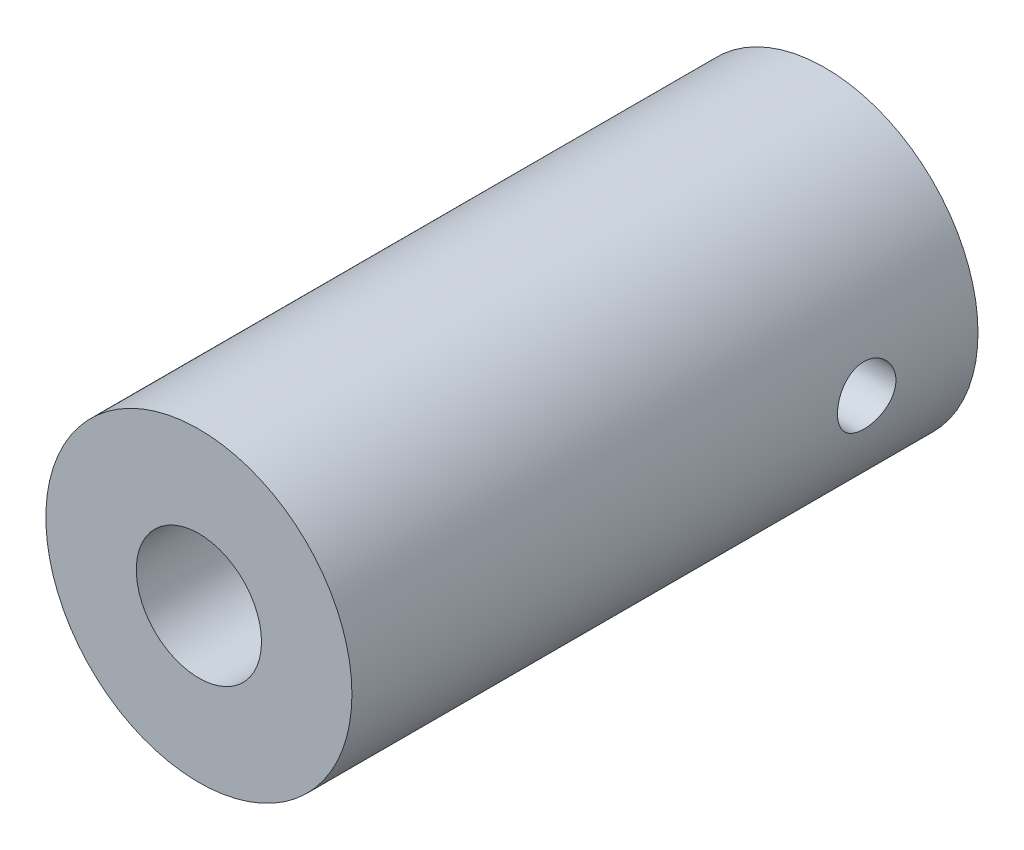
ISO-10303-21;
HEADER;
FILE_DESCRIPTION(('STEP AP214'),'2;1');
FILE_NAME('part.step','',(''),(''),'','','');
FILE_SCHEMA(('AUTOMOTIVE_DESIGN { 1 0 10303 214 1 1 1 1 }'));
ENDSEC;
DATA;
#1=APPLICATION_CONTEXT('core data for automotive mechanical design processes');
#2=APPLICATION_PROTOCOL_DEFINITION('international standard','automotive_design',2000,#1);
#3=PRODUCT_CONTEXT('',#1,'mechanical');
#4=PRODUCT('Part','Part','',(#3));
#5=PRODUCT_RELATED_PRODUCT_CATEGORY('part','',(#4));
#6=PRODUCT_DEFINITION_FORMATION('','',#4);
#7=PRODUCT_DEFINITION_CONTEXT('part definition',#1,'design');
#8=PRODUCT_DEFINITION('design','',#6,#7);
#9=PRODUCT_DEFINITION_SHAPE('','',#8);
#10=(LENGTH_UNIT() NAMED_UNIT(*) SI_UNIT(.MILLI.,.METRE.));
#11=(NAMED_UNIT(*) PLANE_ANGLE_UNIT() SI_UNIT($,.RADIAN.));
#12=(NAMED_UNIT(*) SI_UNIT($,.STERADIAN.) SOLID_ANGLE_UNIT());
#13=UNCERTAINTY_MEASURE_WITH_UNIT(LENGTH_MEASURE(1.E-05),#10,'distance_accuracy_value','');
#14=(GEOMETRIC_REPRESENTATION_CONTEXT(3) GLOBAL_UNCERTAINTY_ASSIGNED_CONTEXT((#13)) GLOBAL_UNIT_ASSIGNED_CONTEXT((#10,
#11,#12)) REPRESENTATION_CONTEXT('',''));
#15=CARTESIAN_POINT('',(0.,0.,0.));
#16=DIRECTION('',(0.,0.,1.));
#17=DIRECTION('',(1.,0.,0.));
#18=AXIS2_PLACEMENT_3D('',#15,#16,#17);
#19=CARTESIAN_POINT('',(0.,0.,45.));
#20=DIRECTION('',(0.,0.,1.));
#21=DIRECTION('',(1.,0.,0.));
#22=AXIS2_PLACEMENT_3D('',#19,#20,#21);
#23=PLANE('',#22);
#24=CARTESIAN_POINT('',(0.,0.,45.));
#25=DIRECTION('',(0.,0.,1.));
#26=DIRECTION('',(1.,0.,0.));
#27=AXIS2_PLACEMENT_3D('',#24,#25,#26);
#28=CIRCLE('',#27,11.);
#29=CARTESIAN_POINT('',(11.,0.,45.));
#30=VERTEX_POINT('',#29);
#31=EDGE_CURVE('E10',#30,#30,#28,.T.);
#32=ORIENTED_EDGE('',*,*,#31,.T.);
#33=EDGE_LOOP('',(#32));
#34=FACE_BOUND('',#33,.T.);
#35=CARTESIAN_POINT('',(0.,0.,45.));
#36=DIRECTION('',(0.,0.,1.));
#37=DIRECTION('',(1.,0.,0.));
#38=AXIS2_PLACEMENT_3D('',#35,#36,#37);
#39=CIRCLE('',#38,4.5);
#40=CARTESIAN_POINT('',(4.5,0.,45.));
#41=VERTEX_POINT('',#40);
#42=EDGE_CURVE('E46',#41,#41,#39,.T.);
#43=ORIENTED_EDGE('',*,*,#42,.F.);
#44=EDGE_LOOP('',(#43));
#45=FACE_BOUND('',#44,.T.);
#46=ADVANCED_FACE('F34',(#34,#45),#23,.T.);
#47=CARTESIAN_POINT('',(0.,0.,0.));
#48=DIRECTION('',(0.,0.,1.));
#49=DIRECTION('',(1.,0.,0.));
#50=AXIS2_PLACEMENT_3D('',#47,#48,#49);
#51=PLANE('',#50);
#52=CARTESIAN_POINT('',(0.,0.,0.));
#53=DIRECTION('',(0.,0.,1.));
#54=DIRECTION('',(1.,0.,0.));
#55=AXIS2_PLACEMENT_3D('',#52,#53,#54);
#56=CIRCLE('',#55,11.);
#57=CARTESIAN_POINT('',(11.,0.,0.));
#58=VERTEX_POINT('',#57);
#59=EDGE_CURVE('E39',#58,#58,#56,.T.);
#60=ORIENTED_EDGE('',*,*,#59,.F.);
#61=EDGE_LOOP('',(#60));
#62=FACE_BOUND('',#61,.T.);
#63=CARTESIAN_POINT('',(0.,0.,0.));
#64=DIRECTION('',(0.,0.,1.));
#65=DIRECTION('',(1.,0.,0.));
#66=AXIS2_PLACEMENT_3D('',#63,#64,#65);
#67=CIRCLE('',#66,4.5);
#68=CARTESIAN_POINT('',(4.5,0.,0.));
#69=VERTEX_POINT('',#68);
#70=EDGE_CURVE('E48',#69,#69,#67,.T.);
#71=ORIENTED_EDGE('',*,*,#70,.T.);
#72=EDGE_LOOP('',(#71));
#73=FACE_BOUND('',#72,.T.);
#74=ADVANCED_FACE('F77',(#62,#73),#51,.F.);
#75=CARTESIAN_POINT('',(0.,0.,45.));
#76=DIRECTION('',(0.,0.,-1.));
#77=DIRECTION('',(-1.,0.,0.));
#78=AXIS2_PLACEMENT_3D('',#75,#76,#77);
#79=CYLINDRICAL_SURFACE('',#78,11.);
#80=CARTESIAN_POINT('',(11.,0.,5.90000000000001));
#81=CARTESIAN_POINT('',(10.9999978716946,-0.116820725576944,5.90000442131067));
#82=CARTESIAN_POINT('',(10.998119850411,-0.233698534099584,5.90978085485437));
#83=CARTESIAN_POINT('',(10.9908091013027,-0.464157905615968,5.94860153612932));
#84=CARTESIAN_POINT('',(10.9853734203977,-0.57773664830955,5.977661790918));
#85=CARTESIAN_POINT('',(10.971555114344,-0.798231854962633,6.05412567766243));
#86=CARTESIAN_POINT('',(10.9631751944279,-0.905154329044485,6.10151247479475));
#87=CARTESIAN_POINT('',(10.9443823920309,-1.10952197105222,6.2132359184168));
#88=CARTESIAN_POINT('',(10.9339696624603,-1.20696785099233,6.27757129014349));
#89=CARTESIAN_POINT('',(10.9121153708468,-1.39083315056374,6.42221180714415));
#90=CARTESIAN_POINT('',(10.9006636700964,-1.47711814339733,6.50268631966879));
#91=CARTESIAN_POINT('',(10.8780969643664,-1.63504914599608,6.67695647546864));
#92=CARTESIAN_POINT('',(10.8669819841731,-1.70669408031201,6.77075309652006));
#93=CARTESIAN_POINT('',(10.846248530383,-1.83387383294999,6.96995946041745));
#94=CARTESIAN_POINT('',(10.8366431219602,-1.88927125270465,7.07545840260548));
#95=CARTESIAN_POINT('',(10.8201595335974,-1.98150370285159,7.2944798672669));
#96=CARTESIAN_POINT('',(10.8132811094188,-2.01834039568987,7.4080016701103));
#97=CARTESIAN_POINT('',(10.8031324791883,-2.07197297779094,7.63840588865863));
#98=CARTESIAN_POINT('',(10.7998200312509,-2.08900368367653,7.75523174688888));
#99=CARTESIAN_POINT('',(10.7970511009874,-2.10326984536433,7.99012603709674));
#100=CARTESIAN_POINT('',(10.7975942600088,-2.10050714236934,8.10819435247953));
#101=CARTESIAN_POINT('',(10.8024367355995,-2.07545516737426,8.34051636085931));
#102=CARTESIAN_POINT('',(10.8066845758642,-2.05343348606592,8.45480014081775));
#103=CARTESIAN_POINT('',(10.8183768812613,-1.99091034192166,8.67802067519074));
#104=CARTESIAN_POINT('',(10.8258214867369,-1.95040806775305,8.78695719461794));
#105=CARTESIAN_POINT('',(10.8431219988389,-1.85181340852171,8.99717070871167));
#106=CARTESIAN_POINT('',(10.8529925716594,-1.79361350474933,9.09839601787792));
#107=CARTESIAN_POINT('',(10.8740232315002,-1.66135166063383,9.28974462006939));
#108=CARTESIAN_POINT('',(10.8851834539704,-1.5872880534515,9.37986674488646));
#109=CARTESIAN_POINT('',(10.9077598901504,-1.42396113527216,9.54799627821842));
#110=CARTESIAN_POINT('',(10.9191773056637,-1.33446907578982,9.62578148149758));
#111=CARTESIAN_POINT('',(10.9408141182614,-1.14358963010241,9.76526924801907));
#112=CARTESIAN_POINT('',(10.9510335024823,-1.04220211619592,9.82697163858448));
#113=CARTESIAN_POINT('',(10.9691445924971,-0.830173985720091,9.9325772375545));
#114=CARTESIAN_POINT('',(10.9770331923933,-0.719521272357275,9.9764567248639));
#115=CARTESIAN_POINT('',(10.9895700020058,-0.492231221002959,10.0449430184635));
#116=CARTESIAN_POINT('',(10.994218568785,-0.375594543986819,10.0695519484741));
#117=CARTESIAN_POINT('',(10.9997023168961,-0.141558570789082,10.098487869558));
#118=CARTESIAN_POINT('',(11.0005947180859,-0.0241982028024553,10.1031192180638));
#119=CARTESIAN_POINT('',(10.9986238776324,0.209619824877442,10.092785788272));
#120=CARTESIAN_POINT('',(10.9957608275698,0.326077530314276,10.0778220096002));
#121=CARTESIAN_POINT('',(10.9866364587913,0.553814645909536,10.0289760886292));
#122=CARTESIAN_POINT('',(10.9804029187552,0.665128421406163,9.99524852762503));
#123=CARTESIAN_POINT('',(10.9652337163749,0.880521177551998,9.91000016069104));
#124=CARTESIAN_POINT('',(10.9562978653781,0.984599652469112,9.85847811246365));
#125=CARTESIAN_POINT('',(10.9365725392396,1.18386224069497,9.73843371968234));
#126=CARTESIAN_POINT('',(10.9257632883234,1.27893275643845,9.66972613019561));
#127=CARTESIAN_POINT('',(10.9035399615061,1.45630391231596,9.51751097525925));
#128=CARTESIAN_POINT('',(10.8921258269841,1.53860331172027,9.4340019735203));
#129=CARTESIAN_POINT('',(10.8697885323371,1.68925742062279,9.2531745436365));
#130=CARTESIAN_POINT('',(10.8588743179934,1.75740408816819,9.15568149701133));
#131=CARTESIAN_POINT('',(10.8389551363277,1.87635388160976,8.95045311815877));
#132=CARTESIAN_POINT('',(10.8299500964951,1.92715766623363,8.84271817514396));
#133=CARTESIAN_POINT('',(10.8149396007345,2.00968750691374,8.6205830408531));
#134=CARTESIAN_POINT('',(10.8089194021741,2.0415074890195,8.50621878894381));
#135=CARTESIAN_POINT('',(10.8005271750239,2.08545491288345,8.27364102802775));
#136=CARTESIAN_POINT('',(10.7981547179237,2.09758466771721,8.15542797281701));
#137=CARTESIAN_POINT('',(10.7973488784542,2.10172771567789,7.92059341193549));
#138=CARTESIAN_POINT('',(10.7988512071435,2.09406932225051,7.8039777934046));
#139=CARTESIAN_POINT('',(10.8054828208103,2.05957380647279,7.57372906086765));
#140=CARTESIAN_POINT('',(10.8106120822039,2.03273680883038,7.4600959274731));
#141=CARTESIAN_POINT('',(10.8238920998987,1.96078655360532,7.23922302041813));
#142=CARTESIAN_POINT('',(10.8320367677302,1.91571010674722,7.13197086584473));
#143=CARTESIAN_POINT('',(10.8504339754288,1.80859687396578,6.92649945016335));
#144=CARTESIAN_POINT('',(10.8606866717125,1.74655882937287,6.82828086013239));
#145=CARTESIAN_POINT('',(10.882343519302,1.60614737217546,6.64202264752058));
#146=CARTESIAN_POINT('',(10.8937630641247,1.52753550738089,6.55416454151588));
#147=CARTESIAN_POINT('',(10.9163530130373,1.35670385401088,6.39277743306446));
#148=CARTESIAN_POINT('',(10.9275233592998,1.26448094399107,6.31925172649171));
#149=CARTESIAN_POINT('',(10.9484794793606,1.06800710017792,6.18796989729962));
#150=CARTESIAN_POINT('',(10.9582512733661,0.963651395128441,6.13036826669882));
#151=CARTESIAN_POINT('',(10.9751724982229,0.746588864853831,6.03360797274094));
#152=CARTESIAN_POINT('',(10.9823243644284,0.633889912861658,5.99443217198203));
#153=CARTESIAN_POINT('',(10.9917600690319,0.434066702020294,5.94349243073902));
#154=CARTESIAN_POINT('',(10.9948324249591,0.348102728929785,5.92721096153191));
#155=CARTESIAN_POINT('',(10.9989531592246,0.174769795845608,5.90546323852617));
#156=CARTESIAN_POINT('',(11.0000015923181,0.0874008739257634,5.89999669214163));
#157=CARTESIAN_POINT('',(11.,0.,5.90000000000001));
#158=B_SPLINE_CURVE_WITH_KNOTS('',3,(#80,#81,#82,#83,#84,#85,#86,#87,#88,#89,#90,#91,#92,#93,
#94,#95,#96,#97,#98,#99,#100,#101,#102,#103,#104,#105,#106,#107,#108,#109,#110,#111,#112,#113,
#114,#115,#116,#117,#118,#119,#120,#121,#122,#123,#124,#125,#126,#127,#128,#129,#130,#131,#132,
#133,#134,#135,#136,#137,#138,#139,#140,#141,#142,#143,#144,#145,#146,#147,#148,#149,#150,#151,
#152,#153,#154,#155,#156,#157),.UNSPECIFIED.,.T.,.F.,(4,2,2,2,2,2,2,2,2,2,2,2,2,2,2,2,2,2,2,2,2,
2,2,2,2,2,2,2,2,2,2,2,2,2,2,2,2,2,4),(0.,0.350142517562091,0.700576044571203,1.05068842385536,
1.40077447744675,1.75474719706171,2.10874590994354,2.46565720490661,2.82253652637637,
3.17514016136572,3.52771099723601,3.87545955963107,4.22322339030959,4.5731437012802,
4.92310079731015,5.27878057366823,5.63446416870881,5.99061961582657,6.34673580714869,
6.69740698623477,7.0480602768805,7.39586667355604,7.74369735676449,8.09545238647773,
8.44724156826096,8.80388396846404,9.16051282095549,9.51536222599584,9.87016994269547,
10.2191288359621,10.5680854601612,10.9163413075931,11.2646230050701,11.6183069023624,
11.9720720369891,12.3291576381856,12.6859104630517,12.9478810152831,13.2098444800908),.UNSPECIFIED.);
#159=CARTESIAN_POINT('',(11.,0.,5.90000000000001));
#160=VERTEX_POINT('',#159);
#161=EDGE_CURVE('E51',#160,#160,#158,.T.);
#162=ORIENTED_EDGE('',*,*,#161,.T.);
#163=EDGE_LOOP('',(#162));
#164=FACE_BOUND('',#163,.T.);
#165=ORIENTED_EDGE('',*,*,#31,.F.);
#166=EDGE_LOOP('',(#165));
#167=FACE_BOUND('',#166,.T.);
#168=ORIENTED_EDGE('',*,*,#59,.T.);
#169=EDGE_LOOP('',(#168));
#170=FACE_BOUND('',#169,.T.);
#171=ADVANCED_FACE('F36',(#164,#167,#170),#79,.T.);
#172=CARTESIAN_POINT('',(0.,0.,45.));
#173=DIRECTION('',(0.,0.,-1.));
#174=DIRECTION('',(-1.,0.,0.));
#175=AXIS2_PLACEMENT_3D('',#172,#173,#174);
#176=CYLINDRICAL_SURFACE('',#175,4.5);
#177=CARTESIAN_POINT('',(4.5,0.,5.90000000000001));
#178=CARTESIAN_POINT('',(4.49999489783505,-0.111264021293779,5.9000060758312));
#179=CARTESIAN_POINT('',(4.49582799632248,-0.222686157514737,5.90889473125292));
#180=CARTESIAN_POINT('',(4.4795719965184,-0.442291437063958,5.94408163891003));
#181=CARTESIAN_POINT('',(4.46746534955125,-0.55046684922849,5.97041845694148));
#182=CARTESIAN_POINT('',(4.43660817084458,-0.760057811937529,6.03927763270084));
#183=CARTESIAN_POINT('',(4.41788225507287,-0.861496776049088,6.08174006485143));
#184=CARTESIAN_POINT('',(4.37554769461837,-1.05568597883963,6.18136145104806));
#185=CARTESIAN_POINT('',(4.35193986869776,-1.14843767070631,6.23851794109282));
#186=CARTESIAN_POINT('',(4.3005526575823,-1.32833402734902,6.36948602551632));
#187=CARTESIAN_POINT('',(4.27261570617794,-1.41489428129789,6.44403775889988));
#188=CARTESIAN_POINT('',(4.21629940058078,-1.57480810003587,6.60610128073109));
#189=CARTESIAN_POINT('',(4.18791976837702,-1.64815296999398,6.69362153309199));
#190=CARTESIAN_POINT('',(4.13182329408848,-1.78432392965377,6.88601550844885));
#191=CARTESIAN_POINT('',(4.10427039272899,-1.84615201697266,6.99164873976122));
#192=CARTESIAN_POINT('',(4.05553006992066,-1.95090689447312,7.21326250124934));
#193=CARTESIAN_POINT('',(4.03433858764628,-1.99384575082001,7.32923636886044));
#194=CARTESIAN_POINT('',(4.00246921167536,-2.05704583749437,7.5615630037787));
#195=CARTESIAN_POINT('',(3.99127033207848,-2.07843946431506,7.67753302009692));
#196=CARTESIAN_POINT('',(3.9792097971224,-2.1014464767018,7.91191423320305));
#197=CARTESIAN_POINT('',(3.97834008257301,-2.1030752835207,8.03032345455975));
#198=CARTESIAN_POINT('',(3.98660720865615,-2.08734488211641,8.25342826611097));
#199=CARTESIAN_POINT('',(3.99474416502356,-2.07188323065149,8.35830301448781));
#200=CARTESIAN_POINT('',(4.0183815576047,-2.02565458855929,8.56375111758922));
#201=CARTESIAN_POINT('',(4.03388388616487,-1.99488366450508,8.66432335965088));
#202=CARTESIAN_POINT('',(4.07086385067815,-1.9183074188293,8.86110828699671));
#203=CARTESIAN_POINT('',(4.09247103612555,-1.87217176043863,8.95716695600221));
#204=CARTESIAN_POINT('',(4.13921554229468,-1.76641808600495,9.14060899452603));
#205=CARTESIAN_POINT('',(4.16435440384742,-1.70679417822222,9.22798854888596));
#206=CARTESIAN_POINT('',(4.21863777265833,-1.56818654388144,9.401580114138));
#207=CARTESIAN_POINT('',(4.24792084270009,-1.48780370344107,9.48663528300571));
#208=CARTESIAN_POINT('',(4.30494408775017,-1.31371400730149,9.64250174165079));
#209=CARTESIAN_POINT('',(4.3326836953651,-1.22000229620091,9.71330781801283));
#210=CARTESIAN_POINT('',(4.38471347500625,-1.01763010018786,9.84098788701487));
#211=CARTESIAN_POINT('',(4.40884559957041,-0.90855606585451,9.89727584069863));
#212=CARTESIAN_POINT('',(4.4496578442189,-0.681071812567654,9.99027907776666));
#213=CARTESIAN_POINT('',(4.46634314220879,-0.562668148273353,10.0270079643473));
#214=CARTESIAN_POINT('',(4.48933753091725,-0.329445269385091,10.0771630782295));
#215=CARTESIAN_POINT('',(4.49633267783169,-0.215026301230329,10.09213423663));
#216=CARTESIAN_POINT('',(4.50144196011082,0.0148973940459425,10.1030950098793));
#217=CARTESIAN_POINT('',(4.49955954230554,0.130401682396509,10.0990919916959));
#218=CARTESIAN_POINT('',(4.48754815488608,0.35120799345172,10.0732103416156));
#219=CARTESIAN_POINT('',(4.47796715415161,0.456682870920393,10.052519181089));
#220=CARTESIAN_POINT('',(4.45217548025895,0.662492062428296,9.9956220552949));
#221=CARTESIAN_POINT('',(4.43596403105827,0.762825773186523,9.95941427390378));
#222=CARTESIAN_POINT('',(4.39779273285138,0.959019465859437,9.87141590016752));
#223=CARTESIAN_POINT('',(4.37567194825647,1.05464812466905,9.81918177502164));
#224=CARTESIAN_POINT('',(4.32791192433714,1.23612200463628,9.70109835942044));
#225=CARTESIAN_POINT('',(4.30227114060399,1.32196290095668,9.63524308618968));
#226=CARTESIAN_POINT('',(4.24736892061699,1.48939080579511,9.48507413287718));
#227=CARTESIAN_POINT('',(4.21798726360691,1.56994232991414,9.39964737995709));
#228=CARTESIAN_POINT('',(4.1607256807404,1.71596232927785,9.21623307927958));
#229=CARTESIAN_POINT('',(4.13284647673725,1.78142360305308,9.11823956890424));
#230=CARTESIAN_POINT('',(4.08097919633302,1.89730888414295,8.90831939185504));
#231=CARTESIAN_POINT('',(4.05714661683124,1.94717643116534,8.79604395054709));
#232=CARTESIAN_POINT('',(4.01797403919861,2.02679215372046,8.56321090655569));
#233=CARTESIAN_POINT('',(4.0026246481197,2.05656258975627,8.44266263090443));
#234=CARTESIAN_POINT('',(3.98384794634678,2.09268542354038,8.20838667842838));
#235=CARTESIAN_POINT('',(3.97947067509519,2.10090687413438,8.0950237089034));
#236=CARTESIAN_POINT('',(3.98051230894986,2.09893489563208,7.86851926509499));
#237=CARTESIAN_POINT('',(3.98592846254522,2.08874663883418,7.75537773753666));
#238=CARTESIAN_POINT('',(4.00499231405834,2.05192858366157,7.54114990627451));
#239=CARTESIAN_POINT('',(4.01801114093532,2.02655153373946,7.43978606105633));
#240=CARTESIAN_POINT('',(4.05017159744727,1.96148398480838,7.24280257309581));
#241=CARTESIAN_POINT('',(4.06931505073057,1.92178922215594,7.14718465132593));
#242=CARTESIAN_POINT('',(4.11312903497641,1.82622609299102,6.95744518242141));
#243=CARTESIAN_POINT('',(4.13808167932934,1.76946057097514,6.86384228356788));
#244=CARTESIAN_POINT('',(4.19011071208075,1.6424613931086,6.68691527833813));
#245=CARTESIAN_POINT('',(4.21718808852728,1.5722214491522,6.60359600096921));
#246=CARTESIAN_POINT('',(4.27367263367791,1.41196152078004,6.4409395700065));
#247=CARTESIAN_POINT('',(4.30304091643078,1.32066391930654,6.36284111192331));
#248=CARTESIAN_POINT('',(4.35820998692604,1.12529862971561,6.22288485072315));
#249=CARTESIAN_POINT('',(4.38400907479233,1.02122490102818,6.16103477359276));
#250=CARTESIAN_POINT('',(4.42908822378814,0.803416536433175,6.05601875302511));
#251=CARTESIAN_POINT('',(4.44840236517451,0.689736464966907,6.01275478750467));
#252=CARTESIAN_POINT('',(4.47840544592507,0.45573411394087,5.94646588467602));
#253=CARTESIAN_POINT('',(4.48912004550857,0.335432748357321,5.92338071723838));
#254=CARTESIAN_POINT('',(4.4966016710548,0.178484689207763,5.90729147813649));
#255=CARTESIAN_POINT('',(4.49787348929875,0.142859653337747,5.90456014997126));
#256=CARTESIAN_POINT('',(4.4995734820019,0.0714951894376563,5.90091341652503));
#257=CARTESIAN_POINT('',(4.50000163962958,0.035755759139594,5.89999804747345));
#258=CARTESIAN_POINT('',(4.5,0.,5.90000000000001));
#259=B_SPLINE_CURVE_WITH_KNOTS('',3,(#177,#178,#179,#180,#181,#182,#183,#184,#185,#186,#187,
#188,#189,#190,#191,#192,#193,#194,#195,#196,#197,#198,#199,#200,#201,#202,#203,#204,#205,#206,
#207,#208,#209,#210,#211,#212,#213,#214,#215,#216,#217,#218,#219,#220,#221,#222,#223,#224,#225,
#226,#227,#228,#229,#230,#231,#232,#233,#234,#235,#236,#237,#238,#239,#240,#241,#242,#243,#244,
#245,#246,#247,#248,#249,#250,#251,#252,#253,#254,#255,#256,#257,#258),.UNSPECIFIED.,.T.,.F.,(4,
2,2,2,2,2,2,2,2,2,2,2,2,2,2,2,2,2,2,2,2,2,2,2,2,2,2,2,2,2,2,2,2,2,2,2,2,2,2,2,4),(0.,
0.333645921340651,0.668031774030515,1.00118696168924,1.33428631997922,1.68561012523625,
2.03716424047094,2.41164643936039,2.78588907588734,3.13923472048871,3.49230465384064,
3.80978297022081,4.12734289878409,4.45222590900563,4.77725110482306,5.13756590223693,
5.49801229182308,5.87129665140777,6.24432105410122,6.58928826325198,6.934121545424,
7.25637865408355,7.57867349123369,7.91084507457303,8.24316286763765,8.60466262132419,
8.96633453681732,9.33973464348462,9.71272047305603,10.0520844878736,10.3913531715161,
10.7058888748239,11.0205183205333,11.3559884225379,11.6916154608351,12.060923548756,
12.4304069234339,12.7979170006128,13.1643263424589,13.2715445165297,13.378764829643),.UNSPECIFIED.);
#260=CARTESIAN_POINT('',(4.5,0.,5.90000000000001));
#261=VERTEX_POINT('',#260);
#262=EDGE_CURVE('E60',#261,#261,#259,.T.);
#263=ORIENTED_EDGE('',*,*,#262,.F.);
#264=EDGE_LOOP('',(#263));
#265=FACE_BOUND('',#264,.T.);
#266=ORIENTED_EDGE('',*,*,#42,.T.);
#267=EDGE_LOOP('',(#266));
#268=FACE_BOUND('',#267,.T.);
#269=ORIENTED_EDGE('',*,*,#70,.F.);
#270=EDGE_LOOP('',(#269));
#271=FACE_BOUND('',#270,.T.);
#272=ADVANCED_FACE('F68',(#265,#268,#271),#176,.F.);
#273=CARTESIAN_POINT('',(11.,0.,8.));
#274=DIRECTION('',(1.,0.,0.));
#275=DIRECTION('',(0.,0.,-1.));
#276=AXIS2_PLACEMENT_3D('',#273,#274,#275);
#277=CYLINDRICAL_SURFACE('',#276,2.09999999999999);
#278=ORIENTED_EDGE('',*,*,#262,.T.);
#279=EDGE_LOOP('',(#278));
#280=FACE_BOUND('',#279,.T.);
#281=ORIENTED_EDGE('',*,*,#161,.F.);
#282=EDGE_LOOP('',(#281));
#283=FACE_BOUND('',#282,.T.);
#284=ADVANCED_FACE('F65',(#280,#283),#277,.F.);
#285=CLOSED_SHELL('',(#46,#74,#171,#272,#284));
#286=MANIFOLD_SOLID_BREP('B2',#285);
#287=ADVANCED_BREP_SHAPE_REPRESENTATION('',(#18,#286),#14);
#288=SHAPE_DEFINITION_REPRESENTATION(#9,#287);
ENDSEC;
END-ISO-10303-21;
